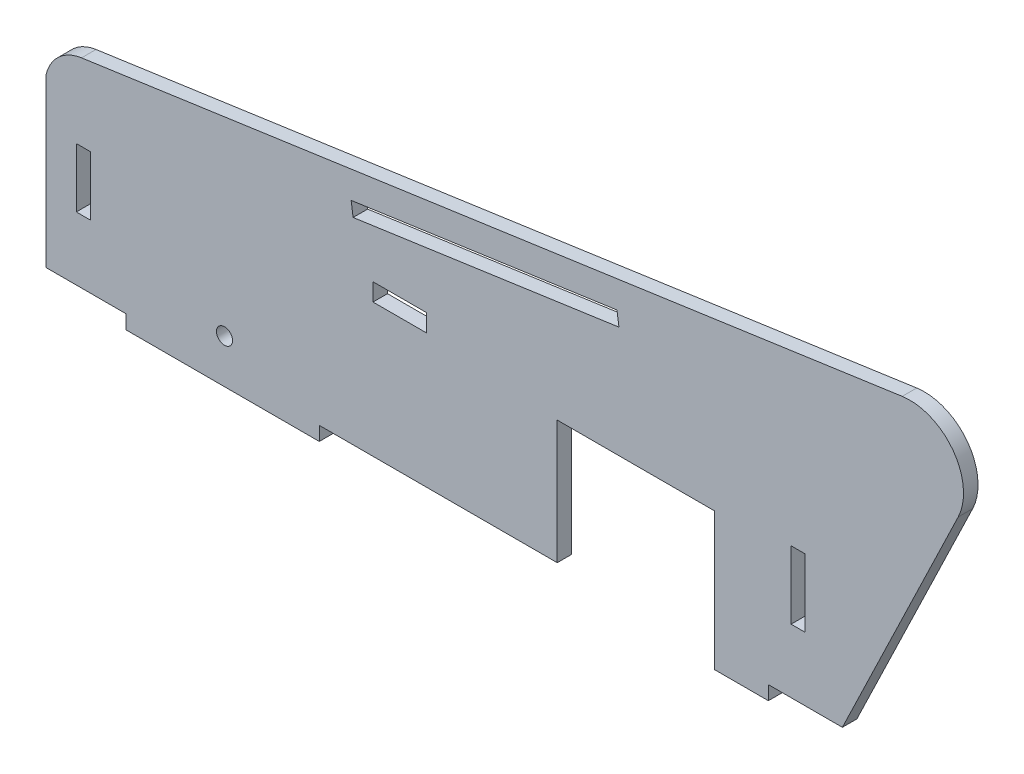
ISO-10303-21;
HEADER;
FILE_DESCRIPTION(('STEP AP214'),'2;1');
FILE_NAME('part.step','',(''),(''),'','','');
FILE_SCHEMA(('AUTOMOTIVE_DESIGN { 1 0 10303 214 1 1 1 1 }'));
ENDSEC;
DATA;
#1=APPLICATION_CONTEXT('core data for automotive mechanical design processes');
#2=APPLICATION_PROTOCOL_DEFINITION('international standard','automotive_design',2000,#1);
#3=PRODUCT_CONTEXT('',#1,'mechanical');
#4=PRODUCT('Part','Part','',(#3));
#5=PRODUCT_RELATED_PRODUCT_CATEGORY('part','',(#4));
#6=PRODUCT_DEFINITION_FORMATION('','',#4);
#7=PRODUCT_DEFINITION_CONTEXT('part definition',#1,'design');
#8=PRODUCT_DEFINITION('design','',#6,#7);
#9=PRODUCT_DEFINITION_SHAPE('','',#8);
#10=(LENGTH_UNIT() NAMED_UNIT(*) SI_UNIT(.MILLI.,.METRE.));
#11=(NAMED_UNIT(*) PLANE_ANGLE_UNIT() SI_UNIT($,.RADIAN.));
#12=(NAMED_UNIT(*) SI_UNIT($,.STERADIAN.) SOLID_ANGLE_UNIT());
#13=UNCERTAINTY_MEASURE_WITH_UNIT(LENGTH_MEASURE(1.E-05),#10,'distance_accuracy_value','');
#14=(GEOMETRIC_REPRESENTATION_CONTEXT(3) GLOBAL_UNCERTAINTY_ASSIGNED_CONTEXT((#13)) GLOBAL_UNIT_ASSIGNED_CONTEXT((#10,
#11,#12)) REPRESENTATION_CONTEXT('',''));
#15=CARTESIAN_POINT('',(0.,0.,0.));
#16=DIRECTION('',(0.,0.,1.));
#17=DIRECTION('',(1.,0.,0.));
#18=AXIS2_PLACEMENT_3D('',#15,#16,#17);
#19=CARTESIAN_POINT('',(125.56052424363,24.1615289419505,2.7));
#20=DIRECTION('',(0.,0.,-1.));
#21=DIRECTION('',(-1.,0.,0.));
#22=AXIS2_PLACEMENT_3D('',#19,#20,#21);
#23=PLANE('',#22);
#24=DIRECTION('',(0.,1.,0.));
#25=VECTOR('',#24,1.);
#26=CARTESIAN_POINT('',(106.053882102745,-0.382796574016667,2.7));
#27=LINE('',#26,#25);
#28=CARTESIAN_POINT('',(106.053882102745,-13.0233806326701,2.7));
#29=VERTEX_POINT('',#28);
#30=CARTESIAN_POINT('',(106.053882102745,-0.382796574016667,2.7));
#31=VERTEX_POINT('',#30);
#32=EDGE_CURVE('E284',#29,#31,#27,.T.);
#33=ORIENTED_EDGE('',*,*,#32,.F.);
#34=DIRECTION('',(1.,0.,0.));
#35=VECTOR('',#34,1.);
#36=CARTESIAN_POINT('',(106.053882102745,-13.0233806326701,2.7));
#37=LINE('',#36,#35);
#38=CARTESIAN_POINT('',(103.453882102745,-13.0233806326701,2.7));
#39=VERTEX_POINT('',#38);
#40=EDGE_CURVE('E292',#39,#29,#37,.T.);
#41=ORIENTED_EDGE('',*,*,#40,.F.);
#42=DIRECTION('',(0.,-1.,0.));
#43=VECTOR('',#42,1.);
#44=CARTESIAN_POINT('',(103.453882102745,-0.382796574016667,2.7));
#45=LINE('',#44,#43);
#46=CARTESIAN_POINT('',(103.453882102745,-0.382796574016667,2.7));
#47=VERTEX_POINT('',#46);
#48=EDGE_CURVE('E289',#47,#39,#45,.T.);
#49=ORIENTED_EDGE('',*,*,#48,.F.);
#50=DIRECTION('',(-1.,0.,0.));
#51=VECTOR('',#50,1.);
#52=CARTESIAN_POINT('',(106.053882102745,-0.382796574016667,2.7));
#53=LINE('',#52,#51);
#54=EDGE_CURVE('E286',#31,#47,#53,.T.);
#55=ORIENTED_EDGE('',*,*,#54,.F.);
#56=EDGE_LOOP('',(#33,#41,#49,#55));
#57=FACE_BOUND('',#56,.T.);
#58=DIRECTION('',(0.,-1.,0.));
#59=VECTOR('',#58,1.);
#60=CARTESIAN_POINT('',(25.6062992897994,3.27012930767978,2.7));
#61=LINE('',#60,#59);
#62=CARTESIAN_POINT('',(25.6062992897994,3.27012930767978,2.7));
#63=VERTEX_POINT('',#62);
#64=CARTESIAN_POINT('',(25.6062992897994,0.,2.7));
#65=VERTEX_POINT('',#64);
#66=EDGE_CURVE('E346',#63,#65,#61,.T.);
#67=ORIENTED_EDGE('',*,*,#66,.F.);
#68=DIRECTION('',(-1.,0.,0.));
#69=VECTOR('',#68,1.);
#70=CARTESIAN_POINT('',(25.6062992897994,3.27012930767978,2.7));
#71=LINE('',#70,#69);
#72=CARTESIAN_POINT('',(35.6062992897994,3.27012930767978,2.7));
#73=VERTEX_POINT('',#72);
#74=EDGE_CURVE('E354',#73,#63,#71,.T.);
#75=ORIENTED_EDGE('',*,*,#74,.F.);
#76=DIRECTION('',(0.,1.,0.));
#77=VECTOR('',#76,1.);
#78=CARTESIAN_POINT('',(35.6062992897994,3.27012930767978,2.7));
#79=LINE('',#78,#77);
#80=CARTESIAN_POINT('',(35.6062992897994,0.,2.7));
#81=VERTEX_POINT('',#80);
#82=EDGE_CURVE('E351',#81,#73,#79,.T.);
#83=ORIENTED_EDGE('',*,*,#82,.F.);
#84=DIRECTION('',(1.,0.,0.));
#85=VECTOR('',#84,1.);
#86=CARTESIAN_POINT('',(25.6062992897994,0.,2.7));
#87=LINE('',#86,#85);
#88=EDGE_CURVE('E348',#65,#81,#87,.T.);
#89=ORIENTED_EDGE('',*,*,#88,.F.);
#90=EDGE_LOOP('',(#67,#75,#83,#89));
#91=FACE_BOUND('',#90,.T.);
#92=DIRECTION('',(0.,-1.,0.));
#93=VECTOR('',#92,1.);
#94=CARTESIAN_POINT('',(-20.3937007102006,-24.8827556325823,2.7));
#95=LINE('',#94,#93);
#96=CARTESIAN_POINT('',(-20.3937007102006,-24.8827556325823,2.7));
#97=VERTEX_POINT('',#96);
#98=CARTESIAN_POINT('',(-20.3937007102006,-27.4827556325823,2.7));
#99=VERTEX_POINT('',#98);
#100=EDGE_CURVE('E377',#97,#99,#95,.T.);
#101=ORIENTED_EDGE('',*,*,#100,.T.);
#102=DIRECTION('',(1.,0.,0.));
#103=VECTOR('',#102,1.);
#104=CARTESIAN_POINT('',(-20.3937007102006,-27.4827556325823,2.7));
#105=LINE('',#104,#103);
#106=CARTESIAN_POINT('',(15.6062992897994,-27.4827556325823,2.7));
#107=VERTEX_POINT('',#106);
#108=EDGE_CURVE('E380',#99,#107,#105,.T.);
#109=ORIENTED_EDGE('',*,*,#108,.T.);
#110=DIRECTION('',(0.,1.,0.));
#111=VECTOR('',#110,1.);
#112=CARTESIAN_POINT('',(15.6062992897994,-24.8827556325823,2.7));
#113=LINE('',#112,#111);
#114=CARTESIAN_POINT('',(15.6062992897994,-24.8827556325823,2.7));
#115=VERTEX_POINT('',#114);
#116=EDGE_CURVE('E383',#107,#115,#113,.T.);
#117=ORIENTED_EDGE('',*,*,#116,.T.);
#118=DIRECTION('',(1.,0.,0.));
#119=VECTOR('',#118,1.);
#120=CARTESIAN_POINT('',(15.6062992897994,-24.8827556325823,2.7));
#121=LINE('',#120,#119);
#122=CARTESIAN_POINT('',(59.9112992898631,-24.8827556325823,2.7));
#123=VERTEX_POINT('',#122);
#124=EDGE_CURVE('E385',#115,#123,#121,.T.);
#125=ORIENTED_EDGE('',*,*,#124,.T.);
#126=DIRECTION('',(0.,1.,0.));
#127=VECTOR('',#126,1.);
#128=CARTESIAN_POINT('',(59.9112992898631,-24.8827556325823,2.7));
#129=LINE('',#128,#127);
#130=CARTESIAN_POINT('',(59.9112992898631,-1.88275563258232,2.7));
#131=VERTEX_POINT('',#130);
#132=EDGE_CURVE('E387',#123,#131,#129,.T.);
#133=ORIENTED_EDGE('',*,*,#132,.T.);
#134=DIRECTION('',(1.,0.,0.));
#135=VECTOR('',#134,1.);
#136=CARTESIAN_POINT('',(59.9112992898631,-1.88275563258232,2.7));
#137=LINE('',#136,#135);
#138=CARTESIAN_POINT('',(89.2162992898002,-1.88275563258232,2.7));
#139=VERTEX_POINT('',#138);
#140=EDGE_CURVE('E389',#131,#139,#137,.T.);
#141=ORIENTED_EDGE('',*,*,#140,.T.);
#142=DIRECTION('',(0.,-1.,0.));
#143=VECTOR('',#142,1.);
#144=CARTESIAN_POINT('',(89.2162992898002,-6.88275563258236,2.7));
#145=LINE('',#144,#143);
#146=CARTESIAN_POINT('',(89.2162992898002,-27.4827556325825,2.7));
#147=VERTEX_POINT('',#146);
#148=EDGE_CURVE('E391',#139,#147,#145,.T.);
#149=ORIENTED_EDGE('',*,*,#148,.T.);
#150=DIRECTION('',(1.,0.,0.));
#151=VECTOR('',#150,1.);
#152=CARTESIAN_POINT('',(89.2162992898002,-27.4827556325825,2.7));
#153=LINE('',#152,#151);
#154=CARTESIAN_POINT('',(99.2227511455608,-27.4827556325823,2.7));
#155=VERTEX_POINT('',#154);
#156=EDGE_CURVE('E393',#147,#155,#153,.T.);
#157=ORIENTED_EDGE('',*,*,#156,.T.);
#158=DIRECTION('',(0.,1.,0.));
#159=VECTOR('',#158,1.);
#160=CARTESIAN_POINT('',(99.2227511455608,-27.4827556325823,2.7));
#161=LINE('',#160,#159);
#162=CARTESIAN_POINT('',(99.2227511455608,-24.8827556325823,2.7));
#163=VERTEX_POINT('',#162);
#164=EDGE_CURVE('E395',#155,#163,#161,.T.);
#165=ORIENTED_EDGE('',*,*,#164,.T.);
#166=DIRECTION('',(1.,0.,0.));
#167=VECTOR('',#166,1.);
#168=CARTESIAN_POINT('',(99.2227511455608,-24.8827556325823,2.7));
#169=LINE('',#168,#167);
#170=CARTESIAN_POINT('',(113.001197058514,-24.8827556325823,2.7));
#171=VERTEX_POINT('',#170);
#172=EDGE_CURVE('E397',#163,#171,#169,.T.);
#173=ORIENTED_EDGE('',*,*,#172,.T.);
#174=DIRECTION('',(0.434537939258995,0.900653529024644,0.));
#175=VECTOR('',#174,1.);
#176=CARTESIAN_POINT('',(134.567059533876,19.8161495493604,2.7));
#177=LINE('',#176,#175);
#178=CARTESIAN_POINT('',(134.567059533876,19.8161495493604,2.7));
#179=VERTEX_POINT('',#178);
#180=EDGE_CURVE('E399',#171,#179,#177,.T.);
#181=ORIENTED_EDGE('',*,*,#180,.T.);
#182=CARTESIAN_POINT('',(125.56052424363,24.1615289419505,2.7));
#183=DIRECTION('',(0.,0.,1.));
#184=DIRECTION('',(-1.,0.,0.));
#185=AXIS2_PLACEMENT_3D('',#182,#183,#184);
#186=CIRCLE('',#185,10.);
#187=CARTESIAN_POINT('',(124.146911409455,34.0611096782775,2.7));
#188=VERTEX_POINT('',#187);
#189=EDGE_CURVE('E401',#179,#188,#186,.T.);
#190=ORIENTED_EDGE('',*,*,#189,.T.);
#191=DIRECTION('',(-0.989958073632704,-0.141361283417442,0.));
#192=VECTOR('',#191,1.);
#193=CARTESIAN_POINT('',(124.146911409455,34.0611096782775,2.7));
#194=LINE('',#193,#192);
#195=CARTESIAN_POINT('',(-28.6699184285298,12.2395964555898,2.7));
#196=VERTEX_POINT('',#195);
#197=EDGE_CURVE('E403',#188,#196,#194,.T.);
#198=ORIENTED_EDGE('',*,*,#197,.T.);
#199=CARTESIAN_POINT('',(-27.5459849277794,4.36865034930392,2.7));
#200=DIRECTION('',(0.,0.,1.));
#201=DIRECTION('',(1.,0.,0.));
#202=AXIS2_PLACEMENT_3D('',#199,#200,#201);
#203=CIRCLE('',#202,7.95078732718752);
#204=CARTESIAN_POINT('',(-35.2811932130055,6.20755543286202,2.7));
#205=VERTEX_POINT('',#204);
#206=EDGE_CURVE('E405',#196,#205,#203,.T.);
#207=ORIENTED_EDGE('',*,*,#206,.T.);
#208=DIRECTION('',(0.,-1.,0.));
#209=VECTOR('',#208,1.);
#210=CARTESIAN_POINT('',(-35.2811932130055,6.20755543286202,2.7));
#211=LINE('',#210,#209);
#212=CARTESIAN_POINT('',(-35.2811932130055,-24.8827556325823,2.7));
#213=VERTEX_POINT('',#212);
#214=EDGE_CURVE('E407',#205,#213,#211,.T.);
#215=ORIENTED_EDGE('',*,*,#214,.T.);
#216=DIRECTION('',(1.,0.,0.));
#217=VECTOR('',#216,1.);
#218=CARTESIAN_POINT('',(-35.2811932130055,-24.8827556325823,2.7));
#219=LINE('',#218,#217);
#220=EDGE_CURVE('E409',#213,#97,#219,.T.);
#221=ORIENTED_EDGE('',*,*,#220,.T.);
#222=EDGE_LOOP('',(#101,#109,#117,#125,#133,#141,#149,#157,#165,#173,#181,#190,#198,#207,#215,#221));
#223=FACE_BOUND('',#222,.T.);
#224=DIRECTION('',(0.,1.,0.));
#225=VECTOR('',#224,1.);
#226=CARTESIAN_POINT('',(-27.0386671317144,-2.06019081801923,2.7));
#227=LINE('',#226,#225);
#228=CARTESIAN_POINT('',(-27.0386671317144,-13.0984057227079,2.7));
#229=VERTEX_POINT('',#228);
#230=CARTESIAN_POINT('',(-27.0386671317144,-2.06019081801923,2.7));
#231=VERTEX_POINT('',#230);
#232=EDGE_CURVE('E315',#229,#231,#227,.T.);
#233=ORIENTED_EDGE('',*,*,#232,.F.);
#234=DIRECTION('',(1.,0.,0.));
#235=VECTOR('',#234,1.);
#236=CARTESIAN_POINT('',(-27.0386671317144,-13.0984057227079,2.7));
#237=LINE('',#236,#235);
#238=CARTESIAN_POINT('',(-29.6386671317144,-13.0984057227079,2.7));
#239=VERTEX_POINT('',#238);
#240=EDGE_CURVE('E323',#239,#229,#237,.T.);
#241=ORIENTED_EDGE('',*,*,#240,.F.);
#242=DIRECTION('',(0.,-1.,0.));
#243=VECTOR('',#242,1.);
#244=CARTESIAN_POINT('',(-29.6386671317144,-2.06019081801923,2.7));
#245=LINE('',#244,#243);
#246=CARTESIAN_POINT('',(-29.6386671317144,-2.06019081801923,2.7));
#247=VERTEX_POINT('',#246);
#248=EDGE_CURVE('E320',#247,#239,#245,.T.);
#249=ORIENTED_EDGE('',*,*,#248,.F.);
#250=DIRECTION('',(-1.,0.,0.));
#251=VECTOR('',#250,1.);
#252=CARTESIAN_POINT('',(-27.0386671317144,-2.06019081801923,2.7));
#253=LINE('',#252,#251);
#254=EDGE_CURVE('E317',#231,#247,#253,.T.);
#255=ORIENTED_EDGE('',*,*,#254,.F.);
#256=EDGE_LOOP('',(#233,#241,#249,#255));
#257=FACE_BOUND('',#256,.T.);
#258=DIRECTION('',(0.141361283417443,-0.989958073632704,0.));
#259=VECTOR('',#258,1.);
#260=CARTESIAN_POINT('',(21.5347916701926,14.3578702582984,2.7));
#261=LINE('',#260,#259);
#262=CARTESIAN_POINT('',(21.5347916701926,14.3578702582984,2.7));
#263=VERTEX_POINT('',#262);
#264=CARTESIAN_POINT('',(21.902331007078,11.7839792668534,2.7));
#265=VERTEX_POINT('',#264);
#266=EDGE_CURVE('E245',#263,#265,#261,.T.);
#267=ORIENTED_EDGE('',*,*,#266,.F.);
#268=DIRECTION('',(-0.989958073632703,-0.141361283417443,0.));
#269=VECTOR('',#268,1.);
#270=CARTESIAN_POINT('',(71.0326953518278,21.4259344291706,2.7));
#271=LINE('',#270,#269);
#272=CARTESIAN_POINT('',(71.0326953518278,21.4259344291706,2.7));
#273=VERTEX_POINT('',#272);
#274=EDGE_CURVE('E268',#273,#263,#271,.T.);
#275=ORIENTED_EDGE('',*,*,#274,.F.);
#276=DIRECTION('',(-0.141361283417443,0.989958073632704,0.));
#277=VECTOR('',#276,1.);
#278=CARTESIAN_POINT('',(71.0326953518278,21.4259344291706,2.7));
#279=LINE('',#278,#277);
#280=CARTESIAN_POINT('',(71.4002346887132,18.8520434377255,2.7));
#281=VERTEX_POINT('',#280);
#282=EDGE_CURVE('E266',#281,#273,#279,.T.);
#283=ORIENTED_EDGE('',*,*,#282,.F.);
#284=DIRECTION('',(0.989958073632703,0.141361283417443,0.));
#285=VECTOR('',#284,1.);
#286=CARTESIAN_POINT('',(71.4002346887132,18.8520434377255,2.7));
#287=LINE('',#286,#285);
#288=EDGE_CURVE('E253',#265,#281,#287,.T.);
#289=ORIENTED_EDGE('',*,*,#288,.F.);
#290=EDGE_LOOP('',(#267,#275,#283,#289));
#291=FACE_BOUND('',#290,.T.);
#292=CARTESIAN_POINT('',(-2.04276098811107,-19.301130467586,2.7));
#293=DIRECTION('',(0.,0.,1.));
#294=DIRECTION('',(1.,0.,0.));
#295=AXIS2_PLACEMENT_3D('',#292,#293,#294);
#296=CIRCLE('',#295,1.5);
#297=CARTESIAN_POINT('',(-3.54276098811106,-19.301130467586,2.7));
#298=VERTEX_POINT('',#297);
#299=EDGE_CURVE('E274',#298,#298,#296,.T.);
#300=ORIENTED_EDGE('',*,*,#299,.F.);
#301=EDGE_LOOP('',(#300));
#302=FACE_BOUND('',#301,.T.);
#303=ADVANCED_FACE('F36',(#57,#91,#223,#257,#291,#302),#23,.F.);
#304=CARTESIAN_POINT('',(125.56052424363,24.1615289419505,0.));
#305=DIRECTION('',(0.,0.,-1.));
#306=DIRECTION('',(-1.,0.,0.));
#307=AXIS2_PLACEMENT_3D('',#304,#305,#306);
#308=PLANE('',#307);
#309=DIRECTION('',(-0.989958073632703,-0.141361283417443,0.));
#310=VECTOR('',#309,1.);
#311=CARTESIAN_POINT('',(71.0326953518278,21.4259344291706,0.));
#312=LINE('',#311,#310);
#313=CARTESIAN_POINT('',(71.0326953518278,21.4259344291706,0.));
#314=VERTEX_POINT('',#313);
#315=CARTESIAN_POINT('',(21.5347916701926,14.3578702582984,0.));
#316=VERTEX_POINT('',#315);
#317=EDGE_CURVE('E254',#314,#316,#312,.T.);
#318=ORIENTED_EDGE('',*,*,#317,.T.);
#319=DIRECTION('',(0.141361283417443,-0.989958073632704,0.));
#320=VECTOR('',#319,1.);
#321=CARTESIAN_POINT('',(21.5347916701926,14.3578702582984,0.));
#322=LINE('',#321,#320);
#323=CARTESIAN_POINT('',(21.902331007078,11.7839792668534,0.));
#324=VERTEX_POINT('',#323);
#325=EDGE_CURVE('E59',#316,#324,#322,.T.);
#326=ORIENTED_EDGE('',*,*,#325,.T.);
#327=DIRECTION('',(0.989958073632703,0.141361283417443,0.));
#328=VECTOR('',#327,1.);
#329=CARTESIAN_POINT('',(71.4002346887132,18.8520434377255,0.));
#330=LINE('',#329,#328);
#331=CARTESIAN_POINT('',(71.4002346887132,18.8520434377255,0.));
#332=VERTEX_POINT('',#331);
#333=EDGE_CURVE('E260',#324,#332,#330,.T.);
#334=ORIENTED_EDGE('',*,*,#333,.T.);
#335=DIRECTION('',(-0.141361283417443,0.989958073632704,0.));
#336=VECTOR('',#335,1.);
#337=CARTESIAN_POINT('',(71.0326953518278,21.4259344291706,0.));
#338=LINE('',#337,#336);
#339=EDGE_CURVE('E276',#332,#314,#338,.T.);
#340=ORIENTED_EDGE('',*,*,#339,.T.);
#341=EDGE_LOOP('',(#318,#326,#334,#340));
#342=FACE_BOUND('',#341,.T.);
#343=DIRECTION('',(1.,0.,0.));
#344=VECTOR('',#343,1.);
#345=CARTESIAN_POINT('',(106.053882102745,-13.0233806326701,0.));
#346=LINE('',#345,#344);
#347=CARTESIAN_POINT('',(103.453882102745,-13.0233806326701,0.));
#348=VERTEX_POINT('',#347);
#349=CARTESIAN_POINT('',(106.053882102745,-13.0233806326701,0.));
#350=VERTEX_POINT('',#349);
#351=EDGE_CURVE('E287',#348,#350,#346,.T.);
#352=ORIENTED_EDGE('',*,*,#351,.T.);
#353=DIRECTION('',(0.,1.,0.));
#354=VECTOR('',#353,1.);
#355=CARTESIAN_POINT('',(106.053882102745,-0.382796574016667,0.));
#356=LINE('',#355,#354);
#357=CARTESIAN_POINT('',(106.053882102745,-0.382796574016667,0.));
#358=VERTEX_POINT('',#357);
#359=EDGE_CURVE('E261',#350,#358,#356,.T.);
#360=ORIENTED_EDGE('',*,*,#359,.T.);
#361=DIRECTION('',(-1.,0.,0.));
#362=VECTOR('',#361,1.);
#363=CARTESIAN_POINT('',(106.053882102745,-0.382796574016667,0.));
#364=LINE('',#363,#362);
#365=CARTESIAN_POINT('',(103.453882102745,-0.382796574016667,0.));
#366=VERTEX_POINT('',#365);
#367=EDGE_CURVE('E297',#358,#366,#364,.T.);
#368=ORIENTED_EDGE('',*,*,#367,.T.);
#369=DIRECTION('',(0.,-1.,0.));
#370=VECTOR('',#369,1.);
#371=CARTESIAN_POINT('',(103.453882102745,-0.382796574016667,0.));
#372=LINE('',#371,#370);
#373=EDGE_CURVE('E300',#366,#348,#372,.T.);
#374=ORIENTED_EDGE('',*,*,#373,.T.);
#375=EDGE_LOOP('',(#352,#360,#368,#374));
#376=FACE_BOUND('',#375,.T.);
#377=DIRECTION('',(1.,0.,0.));
#378=VECTOR('',#377,1.);
#379=CARTESIAN_POINT('',(-27.0386671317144,-13.0984057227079,0.));
#380=LINE('',#379,#378);
#381=CARTESIAN_POINT('',(-29.6386671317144,-13.0984057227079,0.));
#382=VERTEX_POINT('',#381);
#383=CARTESIAN_POINT('',(-27.0386671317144,-13.0984057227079,0.));
#384=VERTEX_POINT('',#383);
#385=EDGE_CURVE('E318',#382,#384,#380,.T.);
#386=ORIENTED_EDGE('',*,*,#385,.T.);
#387=DIRECTION('',(0.,1.,0.));
#388=VECTOR('',#387,1.);
#389=CARTESIAN_POINT('',(-27.0386671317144,-2.06019081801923,0.));
#390=LINE('',#389,#388);
#391=CARTESIAN_POINT('',(-27.0386671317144,-2.06019081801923,0.));
#392=VERTEX_POINT('',#391);
#393=EDGE_CURVE('E314',#384,#392,#390,.T.);
#394=ORIENTED_EDGE('',*,*,#393,.T.);
#395=DIRECTION('',(-1.,0.,0.));
#396=VECTOR('',#395,1.);
#397=CARTESIAN_POINT('',(-27.0386671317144,-2.06019081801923,0.));
#398=LINE('',#397,#396);
#399=CARTESIAN_POINT('',(-29.6386671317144,-2.06019081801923,0.));
#400=VERTEX_POINT('',#399);
#401=EDGE_CURVE('E328',#392,#400,#398,.T.);
#402=ORIENTED_EDGE('',*,*,#401,.T.);
#403=DIRECTION('',(0.,-1.,0.));
#404=VECTOR('',#403,1.);
#405=CARTESIAN_POINT('',(-29.6386671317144,-2.06019081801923,0.));
#406=LINE('',#405,#404);
#407=EDGE_CURVE('E331',#400,#382,#406,.T.);
#408=ORIENTED_EDGE('',*,*,#407,.T.);
#409=EDGE_LOOP('',(#386,#394,#402,#408));
#410=FACE_BOUND('',#409,.T.);
#411=DIRECTION('',(-1.,0.,0.));
#412=VECTOR('',#411,1.);
#413=CARTESIAN_POINT('',(25.6062992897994,3.27012930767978,0.));
#414=LINE('',#413,#412);
#415=CARTESIAN_POINT('',(35.6062992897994,3.27012930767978,0.));
#416=VERTEX_POINT('',#415);
#417=CARTESIAN_POINT('',(25.6062992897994,3.27012930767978,0.));
#418=VERTEX_POINT('',#417);
#419=EDGE_CURVE('E349',#416,#418,#414,.T.);
#420=ORIENTED_EDGE('',*,*,#419,.T.);
#421=DIRECTION('',(0.,-1.,0.));
#422=VECTOR('',#421,1.);
#423=CARTESIAN_POINT('',(25.6062992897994,3.27012930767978,0.));
#424=LINE('',#423,#422);
#425=CARTESIAN_POINT('',(25.6062992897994,0.,0.));
#426=VERTEX_POINT('',#425);
#427=EDGE_CURVE('E345',#418,#426,#424,.T.);
#428=ORIENTED_EDGE('',*,*,#427,.T.);
#429=DIRECTION('',(1.,0.,0.));
#430=VECTOR('',#429,1.);
#431=CARTESIAN_POINT('',(25.6062992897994,0.,0.));
#432=LINE('',#431,#430);
#433=CARTESIAN_POINT('',(35.6062992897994,0.,0.));
#434=VERTEX_POINT('',#433);
#435=EDGE_CURVE('E359',#426,#434,#432,.T.);
#436=ORIENTED_EDGE('',*,*,#435,.T.);
#437=DIRECTION('',(0.,1.,0.));
#438=VECTOR('',#437,1.);
#439=CARTESIAN_POINT('',(35.6062992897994,3.27012930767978,0.));
#440=LINE('',#439,#438);
#441=EDGE_CURVE('E362',#434,#416,#440,.T.);
#442=ORIENTED_EDGE('',*,*,#441,.T.);
#443=EDGE_LOOP('',(#420,#428,#436,#442));
#444=FACE_BOUND('',#443,.T.);
#445=DIRECTION('',(0.,-1.,0.));
#446=VECTOR('',#445,1.);
#447=CARTESIAN_POINT('',(-20.3937007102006,-24.8827556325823,0.));
#448=LINE('',#447,#446);
#449=CARTESIAN_POINT('',(-20.3937007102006,-24.8827556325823,0.));
#450=VERTEX_POINT('',#449);
#451=CARTESIAN_POINT('',(-20.3937007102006,-27.4827556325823,0.));
#452=VERTEX_POINT('',#451);
#453=EDGE_CURVE('E376',#450,#452,#448,.T.);
#454=ORIENTED_EDGE('',*,*,#453,.F.);
#455=DIRECTION('',(1.,0.,0.));
#456=VECTOR('',#455,1.);
#457=CARTESIAN_POINT('',(-35.2811932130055,-24.8827556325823,0.));
#458=LINE('',#457,#456);
#459=CARTESIAN_POINT('',(-35.2811932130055,-24.8827556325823,0.));
#460=VERTEX_POINT('',#459);
#461=EDGE_CURVE('E381',#460,#450,#458,.T.);
#462=ORIENTED_EDGE('',*,*,#461,.F.);
#463=DIRECTION('',(0.,-1.,0.));
#464=VECTOR('',#463,1.);
#465=CARTESIAN_POINT('',(-35.2811932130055,6.20755543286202,0.));
#466=LINE('',#465,#464);
#467=CARTESIAN_POINT('',(-35.2811932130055,6.20755543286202,0.));
#468=VERTEX_POINT('',#467);
#469=EDGE_CURVE('E443',#468,#460,#466,.T.);
#470=ORIENTED_EDGE('',*,*,#469,.F.);
#471=CARTESIAN_POINT('',(-27.5459849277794,4.36865034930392,0.));
#472=DIRECTION('',(0.,0.,1.));
#473=DIRECTION('',(1.,0.,0.));
#474=AXIS2_PLACEMENT_3D('',#471,#472,#473);
#475=CIRCLE('',#474,7.95078732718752);
#476=CARTESIAN_POINT('',(-28.6699184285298,12.2395964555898,0.));
#477=VERTEX_POINT('',#476);
#478=EDGE_CURVE('E441',#477,#468,#475,.T.);
#479=ORIENTED_EDGE('',*,*,#478,.F.);
#480=DIRECTION('',(-0.989958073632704,-0.141361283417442,0.));
#481=VECTOR('',#480,1.);
#482=CARTESIAN_POINT('',(124.146911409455,34.0611096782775,0.));
#483=LINE('',#482,#481);
#484=CARTESIAN_POINT('',(124.146911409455,34.0611096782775,0.));
#485=VERTEX_POINT('',#484);
#486=EDGE_CURVE('E439',#485,#477,#483,.T.);
#487=ORIENTED_EDGE('',*,*,#486,.F.);
#488=CARTESIAN_POINT('',(125.56052424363,24.1615289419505,0.));
#489=DIRECTION('',(0.,0.,1.));
#490=DIRECTION('',(-1.,0.,0.));
#491=AXIS2_PLACEMENT_3D('',#488,#489,#490);
#492=CIRCLE('',#491,10.);
#493=CARTESIAN_POINT('',(134.567059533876,19.8161495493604,0.));
#494=VERTEX_POINT('',#493);
#495=EDGE_CURVE('E437',#494,#485,#492,.T.);
#496=ORIENTED_EDGE('',*,*,#495,.F.);
#497=DIRECTION('',(0.434537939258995,0.900653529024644,0.));
#498=VECTOR('',#497,1.);
#499=CARTESIAN_POINT('',(134.567059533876,19.8161495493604,0.));
#500=LINE('',#499,#498);
#501=CARTESIAN_POINT('',(113.001197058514,-24.8827556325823,0.));
#502=VERTEX_POINT('',#501);
#503=EDGE_CURVE('E435',#502,#494,#500,.T.);
#504=ORIENTED_EDGE('',*,*,#503,.F.);
#505=DIRECTION('',(1.,0.,0.));
#506=VECTOR('',#505,1.);
#507=CARTESIAN_POINT('',(99.2227511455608,-24.8827556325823,0.));
#508=LINE('',#507,#506);
#509=CARTESIAN_POINT('',(99.2227511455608,-24.8827556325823,0.));
#510=VERTEX_POINT('',#509);
#511=EDGE_CURVE('E433',#510,#502,#508,.T.);
#512=ORIENTED_EDGE('',*,*,#511,.F.);
#513=DIRECTION('',(0.,1.,0.));
#514=VECTOR('',#513,1.);
#515=CARTESIAN_POINT('',(99.2227511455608,-27.4827556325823,0.));
#516=LINE('',#515,#514);
#517=CARTESIAN_POINT('',(99.2227511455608,-27.4827556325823,0.));
#518=VERTEX_POINT('',#517);
#519=EDGE_CURVE('E431',#518,#510,#516,.T.);
#520=ORIENTED_EDGE('',*,*,#519,.F.);
#521=DIRECTION('',(1.,0.,0.));
#522=VECTOR('',#521,1.);
#523=CARTESIAN_POINT('',(89.2162992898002,-27.4827556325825,0.));
#524=LINE('',#523,#522);
#525=CARTESIAN_POINT('',(89.2162992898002,-27.4827556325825,0.));
#526=VERTEX_POINT('',#525);
#527=EDGE_CURVE('E429',#526,#518,#524,.T.);
#528=ORIENTED_EDGE('',*,*,#527,.F.);
#529=DIRECTION('',(0.,-1.,0.));
#530=VECTOR('',#529,1.);
#531=CARTESIAN_POINT('',(89.2162992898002,-6.88275563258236,0.));
#532=LINE('',#531,#530);
#533=CARTESIAN_POINT('',(89.2162992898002,-1.88275563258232,0.));
#534=VERTEX_POINT('',#533);
#535=EDGE_CURVE('E427',#534,#526,#532,.T.);
#536=ORIENTED_EDGE('',*,*,#535,.F.);
#537=DIRECTION('',(1.,0.,0.));
#538=VECTOR('',#537,1.);
#539=CARTESIAN_POINT('',(59.9112992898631,-1.88275563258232,0.));
#540=LINE('',#539,#538);
#541=CARTESIAN_POINT('',(59.9112992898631,-1.88275563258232,0.));
#542=VERTEX_POINT('',#541);
#543=EDGE_CURVE('E424',#542,#534,#540,.T.);
#544=ORIENTED_EDGE('',*,*,#543,.F.);
#545=DIRECTION('',(0.,1.,0.));
#546=VECTOR('',#545,1.);
#547=CARTESIAN_POINT('',(59.9112992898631,-6.88275563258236,0.));
#548=LINE('',#547,#546);
#549=CARTESIAN_POINT('',(59.9112992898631,-24.8827556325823,0.));
#550=VERTEX_POINT('',#549);
#551=EDGE_CURVE('E422',#550,#542,#548,.T.);
#552=ORIENTED_EDGE('',*,*,#551,.F.);
#553=DIRECTION('',(1.,0.,0.));
#554=VECTOR('',#553,1.);
#555=CARTESIAN_POINT('',(20.2162992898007,-24.8827556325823,0.));
#556=LINE('',#555,#554);
#557=CARTESIAN_POINT('',(15.6062992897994,-24.8827556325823,0.));
#558=VERTEX_POINT('',#557);
#559=EDGE_CURVE('E419',#558,#550,#556,.T.);
#560=ORIENTED_EDGE('',*,*,#559,.F.);
#561=DIRECTION('',(0.,1.,0.));
#562=VECTOR('',#561,1.);
#563=CARTESIAN_POINT('',(15.6062992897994,-24.8827556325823,0.));
#564=LINE('',#563,#562);
#565=CARTESIAN_POINT('',(15.6062992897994,-27.4827556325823,0.));
#566=VERTEX_POINT('',#565);
#567=EDGE_CURVE('E416',#566,#558,#564,.T.);
#568=ORIENTED_EDGE('',*,*,#567,.F.);
#569=DIRECTION('',(1.,0.,0.));
#570=VECTOR('',#569,1.);
#571=CARTESIAN_POINT('',(-20.3937007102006,-27.4827556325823,0.));
#572=LINE('',#571,#570);
#573=EDGE_CURVE('E414',#452,#566,#572,.T.);
#574=ORIENTED_EDGE('',*,*,#573,.F.);
#575=EDGE_LOOP('',(#454,#462,#470,#479,#487,#496,#504,#512,#520,#528,#536,#544,#552,#560,#568,#574));
#576=FACE_BOUND('',#575,.T.);
#577=CARTESIAN_POINT('',(-2.04276098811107,-19.301130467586,0.));
#578=DIRECTION('',(0.,0.,1.));
#579=DIRECTION('',(1.,0.,0.));
#580=AXIS2_PLACEMENT_3D('',#577,#578,#579);
#581=CIRCLE('',#580,1.5);
#582=CARTESIAN_POINT('',(-3.54276098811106,-19.301130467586,0.));
#583=VERTEX_POINT('',#582);
#584=EDGE_CURVE('E906',#583,#583,#581,.T.);
#585=ORIENTED_EDGE('',*,*,#584,.T.);
#586=EDGE_LOOP('',(#585));
#587=FACE_BOUND('',#586,.T.);
#588=ADVANCED_FACE('F496',(#342,#376,#410,#444,#576,#587),#308,.T.);
#589=CARTESIAN_POINT('',(-20.3937007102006,-24.8827556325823,2.7));
#590=DIRECTION('',(1.,0.,0.));
#591=DIRECTION('',(0.,0.,-1.));
#592=AXIS2_PLACEMENT_3D('',#589,#590,#591);
#593=PLANE('',#592);
#594=ORIENTED_EDGE('',*,*,#453,.T.);
#595=DIRECTION('',(0.,0.,-1.));
#596=VECTOR('',#595,1.);
#597=CARTESIAN_POINT('',(-20.3937007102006,-27.4827556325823,2.7));
#598=LINE('',#597,#596);
#599=EDGE_CURVE('E11',#99,#452,#598,.T.);
#600=ORIENTED_EDGE('',*,*,#599,.F.);
#601=ORIENTED_EDGE('',*,*,#100,.F.);
#602=DIRECTION('',(0.,0.,-1.));
#603=VECTOR('',#602,1.);
#604=CARTESIAN_POINT('',(-20.3937007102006,-24.8827556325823,2.7));
#605=LINE('',#604,#603);
#606=EDGE_CURVE('E411',#97,#450,#605,.T.);
#607=ORIENTED_EDGE('',*,*,#606,.T.);
#608=EDGE_LOOP('',(#594,#600,#601,#607));
#609=FACE_BOUND('',#608,.T.);
#610=ADVANCED_FACE('F38',(#609),#593,.F.);
#611=CARTESIAN_POINT('',(-20.3937007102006,-27.4827556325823,2.7));
#612=DIRECTION('',(0.,1.,0.));
#613=DIRECTION('',(0.,0.,1.));
#614=AXIS2_PLACEMENT_3D('',#611,#612,#613);
#615=PLANE('',#614);
#616=ORIENTED_EDGE('',*,*,#573,.T.);
#617=DIRECTION('',(0.,0.,-1.));
#618=VECTOR('',#617,1.);
#619=CARTESIAN_POINT('',(15.6062992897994,-27.4827556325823,2.7));
#620=LINE('',#619,#618);
#621=EDGE_CURVE('E44',#107,#566,#620,.T.);
#622=ORIENTED_EDGE('',*,*,#621,.F.);
#623=ORIENTED_EDGE('',*,*,#108,.F.);
#624=ORIENTED_EDGE('',*,*,#599,.T.);
#625=EDGE_LOOP('',(#616,#622,#623,#624));
#626=FACE_BOUND('',#625,.T.);
#627=ADVANCED_FACE('F513',(#626),#615,.F.);
#628=CARTESIAN_POINT('',(15.6062992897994,-24.8827556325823,2.7));
#629=DIRECTION('',(-1.,0.,0.));
#630=DIRECTION('',(0.,0.,1.));
#631=AXIS2_PLACEMENT_3D('',#628,#629,#630);
#632=PLANE('',#631);
#633=ORIENTED_EDGE('',*,*,#567,.T.);
#634=DIRECTION('',(0.,0.,-1.));
#635=VECTOR('',#634,1.);
#636=CARTESIAN_POINT('',(15.6062992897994,-24.8827556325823,2.7));
#637=LINE('',#636,#635);
#638=EDGE_CURVE('E484',#115,#558,#637,.T.);
#639=ORIENTED_EDGE('',*,*,#638,.F.);
#640=ORIENTED_EDGE('',*,*,#116,.F.);
#641=ORIENTED_EDGE('',*,*,#621,.T.);
#642=EDGE_LOOP('',(#633,#639,#640,#641));
#643=FACE_BOUND('',#642,.T.);
#644=ADVANCED_FACE('F491',(#643),#632,.F.);
#645=CARTESIAN_POINT('',(20.2162992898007,-24.8827556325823,2.7));
#646=DIRECTION('',(0.,1.,0.));
#647=DIRECTION('',(-1.,0.,0.));
#648=AXIS2_PLACEMENT_3D('',#645,#646,#647);
#649=PLANE('',#648);
#650=ORIENTED_EDGE('',*,*,#559,.T.);
#651=DIRECTION('',(0.,0.,-1.));
#652=VECTOR('',#651,1.);
#653=CARTESIAN_POINT('',(59.9112992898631,-24.8827556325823,2.7));
#654=LINE('',#653,#652);
#655=EDGE_CURVE('E481',#123,#550,#654,.T.);
#656=ORIENTED_EDGE('',*,*,#655,.F.);
#657=ORIENTED_EDGE('',*,*,#124,.F.);
#658=ORIENTED_EDGE('',*,*,#638,.T.);
#659=EDGE_LOOP('',(#650,#656,#657,#658));
#660=FACE_BOUND('',#659,.T.);
#661=ADVANCED_FACE('F501',(#660),#649,.F.);
#662=CARTESIAN_POINT('',(59.9112992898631,-6.88275563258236,2.7));
#663=DIRECTION('',(-1.,0.,0.));
#664=DIRECTION('',(0.,0.,1.));
#665=AXIS2_PLACEMENT_3D('',#662,#663,#664);
#666=PLANE('',#665);
#667=ORIENTED_EDGE('',*,*,#551,.T.);
#668=DIRECTION('',(0.,0.,-1.));
#669=VECTOR('',#668,1.);
#670=CARTESIAN_POINT('',(59.9112992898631,-1.88275563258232,2.7));
#671=LINE('',#670,#669);
#672=EDGE_CURVE('E478',#131,#542,#671,.T.);
#673=ORIENTED_EDGE('',*,*,#672,.F.);
#674=ORIENTED_EDGE('',*,*,#132,.F.);
#675=ORIENTED_EDGE('',*,*,#655,.T.);
#676=EDGE_LOOP('',(#667,#673,#674,#675));
#677=FACE_BOUND('',#676,.T.);
#678=ADVANCED_FACE('F505',(#677),#666,.F.);
#679=CARTESIAN_POINT('',(59.9112992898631,-1.88275563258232,2.7));
#680=DIRECTION('',(0.,1.,0.));
#681=DIRECTION('',(0.,0.,1.));
#682=AXIS2_PLACEMENT_3D('',#679,#680,#681);
#683=PLANE('',#682);
#684=ORIENTED_EDGE('',*,*,#543,.T.);
#685=DIRECTION('',(0.,0.,-1.));
#686=VECTOR('',#685,1.);
#687=CARTESIAN_POINT('',(89.2162992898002,-1.88275563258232,2.7));
#688=LINE('',#687,#686);
#689=EDGE_CURVE('E475',#139,#534,#688,.T.);
#690=ORIENTED_EDGE('',*,*,#689,.F.);
#691=ORIENTED_EDGE('',*,*,#140,.F.);
#692=ORIENTED_EDGE('',*,*,#672,.T.);
#693=EDGE_LOOP('',(#684,#690,#691,#692));
#694=FACE_BOUND('',#693,.T.);
#695=ADVANCED_FACE('F563',(#694),#683,.F.);
#696=CARTESIAN_POINT('',(89.2162992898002,-6.88275563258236,2.7));
#697=DIRECTION('',(1.,0.,0.));
#698=DIRECTION('',(0.,0.,-1.));
#699=AXIS2_PLACEMENT_3D('',#696,#697,#698);
#700=PLANE('',#699);
#701=ORIENTED_EDGE('',*,*,#535,.T.);
#702=DIRECTION('',(0.,0.,-1.));
#703=VECTOR('',#702,1.);
#704=CARTESIAN_POINT('',(89.2162992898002,-27.4827556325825,2.7));
#705=LINE('',#704,#703);
#706=EDGE_CURVE('E472',#147,#526,#705,.T.);
#707=ORIENTED_EDGE('',*,*,#706,.F.);
#708=ORIENTED_EDGE('',*,*,#148,.F.);
#709=ORIENTED_EDGE('',*,*,#689,.T.);
#710=EDGE_LOOP('',(#701,#707,#708,#709));
#711=FACE_BOUND('',#710,.T.);
#712=ADVANCED_FACE('F565',(#711),#700,.F.);
#713=CARTESIAN_POINT('',(89.2162992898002,-27.4827556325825,2.7));
#714=DIRECTION('',(0.,1.,0.));
#715=DIRECTION('',(-1.,0.,0.));
#716=AXIS2_PLACEMENT_3D('',#713,#714,#715);
#717=PLANE('',#716);
#718=ORIENTED_EDGE('',*,*,#527,.T.);
#719=DIRECTION('',(0.,0.,-1.));
#720=VECTOR('',#719,1.);
#721=CARTESIAN_POINT('',(99.2227511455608,-27.4827556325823,2.7));
#722=LINE('',#721,#720);
#723=EDGE_CURVE('E469',#155,#518,#722,.T.);
#724=ORIENTED_EDGE('',*,*,#723,.F.);
#725=ORIENTED_EDGE('',*,*,#156,.F.);
#726=ORIENTED_EDGE('',*,*,#706,.T.);
#727=EDGE_LOOP('',(#718,#724,#725,#726));
#728=FACE_BOUND('',#727,.T.);
#729=ADVANCED_FACE('F559',(#728),#717,.F.);
#730=CARTESIAN_POINT('',(99.2227511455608,-27.4827556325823,2.7));
#731=DIRECTION('',(-1.,0.,0.));
#732=DIRECTION('',(0.,0.,1.));
#733=AXIS2_PLACEMENT_3D('',#730,#731,#732);
#734=PLANE('',#733);
#735=ORIENTED_EDGE('',*,*,#519,.T.);
#736=DIRECTION('',(0.,0.,-1.));
#737=VECTOR('',#736,1.);
#738=CARTESIAN_POINT('',(99.2227511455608,-24.8827556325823,2.7));
#739=LINE('',#738,#737);
#740=EDGE_CURVE('E466',#163,#510,#739,.T.);
#741=ORIENTED_EDGE('',*,*,#740,.F.);
#742=ORIENTED_EDGE('',*,*,#164,.F.);
#743=ORIENTED_EDGE('',*,*,#723,.T.);
#744=EDGE_LOOP('',(#735,#741,#742,#743));
#745=FACE_BOUND('',#744,.T.);
#746=ADVANCED_FACE('F555',(#745),#734,.F.);
#747=CARTESIAN_POINT('',(99.2227511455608,-24.8827556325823,2.7));
#748=DIRECTION('',(0.,1.,0.));
#749=DIRECTION('',(0.,0.,1.));
#750=AXIS2_PLACEMENT_3D('',#747,#748,#749);
#751=PLANE('',#750);
#752=ORIENTED_EDGE('',*,*,#511,.T.);
#753=DIRECTION('',(0.,0.,-1.));
#754=VECTOR('',#753,1.);
#755=CARTESIAN_POINT('',(113.001197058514,-24.8827556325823,2.7));
#756=LINE('',#755,#754);
#757=EDGE_CURVE('E463',#171,#502,#756,.T.);
#758=ORIENTED_EDGE('',*,*,#757,.F.);
#759=ORIENTED_EDGE('',*,*,#172,.F.);
#760=ORIENTED_EDGE('',*,*,#740,.T.);
#761=EDGE_LOOP('',(#752,#758,#759,#760));
#762=FACE_BOUND('',#761,.T.);
#763=ADVANCED_FACE('F550',(#762),#751,.F.);
#764=CARTESIAN_POINT('',(134.567059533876,19.8161495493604,2.7));
#765=DIRECTION('',(-0.900653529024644,0.434537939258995,0.));
#766=DIRECTION('',(-0.434537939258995,-0.900653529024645,0.));
#767=AXIS2_PLACEMENT_3D('',#764,#765,#766);
#768=PLANE('',#767);
#769=ORIENTED_EDGE('',*,*,#503,.T.);
#770=DIRECTION('',(0.,0.,-1.));
#771=VECTOR('',#770,1.);
#772=CARTESIAN_POINT('',(134.567059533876,19.8161495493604,2.7));
#773=LINE('',#772,#771);
#774=EDGE_CURVE('E460',#179,#494,#773,.T.);
#775=ORIENTED_EDGE('',*,*,#774,.F.);
#776=ORIENTED_EDGE('',*,*,#180,.F.);
#777=ORIENTED_EDGE('',*,*,#757,.T.);
#778=EDGE_LOOP('',(#769,#775,#776,#777));
#779=FACE_BOUND('',#778,.T.);
#780=ADVANCED_FACE('F544',(#779),#768,.F.);
#781=CARTESIAN_POINT('',(125.56052424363,24.1615289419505,2.7));
#782=DIRECTION('',(0.,0.,-1.));
#783=DIRECTION('',(-1.,0.,0.));
#784=AXIS2_PLACEMENT_3D('',#781,#782,#783);
#785=CYLINDRICAL_SURFACE('',#784,10.);
#786=ORIENTED_EDGE('',*,*,#495,.T.);
#787=DIRECTION('',(0.,0.,-1.));
#788=VECTOR('',#787,1.);
#789=CARTESIAN_POINT('',(124.146911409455,34.0611096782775,2.7));
#790=LINE('',#789,#788);
#791=EDGE_CURVE('E457',#188,#485,#790,.T.);
#792=ORIENTED_EDGE('',*,*,#791,.F.);
#793=ORIENTED_EDGE('',*,*,#189,.F.);
#794=ORIENTED_EDGE('',*,*,#774,.T.);
#795=EDGE_LOOP('',(#786,#792,#793,#794));
#796=FACE_BOUND('',#795,.T.);
#797=ADVANCED_FACE('F540',(#796),#785,.T.);
#798=CARTESIAN_POINT('',(124.146911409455,34.0611096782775,2.7));
#799=DIRECTION('',(0.141361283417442,-0.989958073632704,0.));
#800=DIRECTION('',(0.989958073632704,0.141361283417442,0.));
#801=AXIS2_PLACEMENT_3D('',#798,#799,#800);
#802=PLANE('',#801);
#803=ORIENTED_EDGE('',*,*,#486,.T.);
#804=DIRECTION('',(0.,0.,-1.));
#805=VECTOR('',#804,1.);
#806=CARTESIAN_POINT('',(-28.6699184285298,12.2395964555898,2.7));
#807=LINE('',#806,#805);
#808=EDGE_CURVE('E454',#196,#477,#807,.T.);
#809=ORIENTED_EDGE('',*,*,#808,.F.);
#810=ORIENTED_EDGE('',*,*,#197,.F.);
#811=ORIENTED_EDGE('',*,*,#791,.T.);
#812=EDGE_LOOP('',(#803,#809,#810,#811));
#813=FACE_BOUND('',#812,.T.);
#814=ADVANCED_FACE('F535',(#813),#802,.F.);
#815=CARTESIAN_POINT('',(-27.5459849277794,4.36865034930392,2.7));
#816=DIRECTION('',(0.,0.,-1.));
#817=DIRECTION('',(-1.,0.,0.));
#818=AXIS2_PLACEMENT_3D('',#815,#816,#817);
#819=CYLINDRICAL_SURFACE('',#818,7.95078732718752);
#820=ORIENTED_EDGE('',*,*,#478,.T.);
#821=DIRECTION('',(0.,0.,-1.));
#822=VECTOR('',#821,1.);
#823=CARTESIAN_POINT('',(-35.2811932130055,6.20755543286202,2.7));
#824=LINE('',#823,#822);
#825=EDGE_CURVE('E451',#205,#468,#824,.T.);
#826=ORIENTED_EDGE('',*,*,#825,.F.);
#827=ORIENTED_EDGE('',*,*,#206,.F.);
#828=ORIENTED_EDGE('',*,*,#808,.T.);
#829=EDGE_LOOP('',(#820,#826,#827,#828));
#830=FACE_BOUND('',#829,.T.);
#831=ADVANCED_FACE('F529',(#830),#819,.T.);
#832=CARTESIAN_POINT('',(-35.2811932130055,6.20755543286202,2.7));
#833=DIRECTION('',(1.,0.,0.));
#834=DIRECTION('',(0.,1.,0.));
#835=AXIS2_PLACEMENT_3D('',#832,#833,#834);
#836=PLANE('',#835);
#837=ORIENTED_EDGE('',*,*,#469,.T.);
#838=DIRECTION('',(0.,0.,-1.));
#839=VECTOR('',#838,1.);
#840=CARTESIAN_POINT('',(-35.2811932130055,-24.8827556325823,2.7));
#841=LINE('',#840,#839);
#842=EDGE_CURVE('E448',#213,#460,#841,.T.);
#843=ORIENTED_EDGE('',*,*,#842,.F.);
#844=ORIENTED_EDGE('',*,*,#214,.F.);
#845=ORIENTED_EDGE('',*,*,#825,.T.);
#846=EDGE_LOOP('',(#837,#843,#844,#845));
#847=FACE_BOUND('',#846,.T.);
#848=ADVANCED_FACE('F525',(#847),#836,.F.);
#849=CARTESIAN_POINT('',(-35.2811932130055,-24.8827556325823,2.7));
#850=DIRECTION('',(0.,1.,0.));
#851=DIRECTION('',(-1.,0.,0.));
#852=AXIS2_PLACEMENT_3D('',#849,#850,#851);
#853=PLANE('',#852);
#854=ORIENTED_EDGE('',*,*,#461,.T.);
#855=ORIENTED_EDGE('',*,*,#606,.F.);
#856=ORIENTED_EDGE('',*,*,#220,.F.);
#857=ORIENTED_EDGE('',*,*,#842,.T.);
#858=EDGE_LOOP('',(#854,#855,#856,#857));
#859=FACE_BOUND('',#858,.T.);
#860=ADVANCED_FACE('F520',(#859),#853,.F.);
#861=CARTESIAN_POINT('',(25.6062992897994,3.27012930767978,2.7));
#862=DIRECTION('',(1.,0.,0.));
#863=DIRECTION('',(0.,0.,-1.));
#864=AXIS2_PLACEMENT_3D('',#861,#862,#863);
#865=PLANE('',#864);
#866=ORIENTED_EDGE('',*,*,#427,.F.);
#867=DIRECTION('',(0.,0.,-1.));
#868=VECTOR('',#867,1.);
#869=CARTESIAN_POINT('',(25.6062992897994,3.27012930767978,2.7));
#870=LINE('',#869,#868);
#871=EDGE_CURVE('E356',#63,#418,#870,.T.);
#872=ORIENTED_EDGE('',*,*,#871,.F.);
#873=ORIENTED_EDGE('',*,*,#66,.T.);
#874=DIRECTION('',(0.,0.,-1.));
#875=VECTOR('',#874,1.);
#876=CARTESIAN_POINT('',(25.6062992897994,0.,2.7));
#877=LINE('',#876,#875);
#878=EDGE_CURVE('E373',#65,#426,#877,.T.);
#879=ORIENTED_EDGE('',*,*,#878,.T.);
#880=EDGE_LOOP('',(#866,#872,#873,#879));
#881=FACE_BOUND('',#880,.T.);
#882=ADVANCED_FACE('F585',(#881),#865,.T.);
#883=CARTESIAN_POINT('',(25.6062992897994,0.,2.7));
#884=DIRECTION('',(0.,1.,0.));
#885=DIRECTION('',(-1.,0.,0.));
#886=AXIS2_PLACEMENT_3D('',#883,#884,#885);
#887=PLANE('',#886);
#888=ORIENTED_EDGE('',*,*,#435,.F.);
#889=ORIENTED_EDGE('',*,*,#878,.F.);
#890=ORIENTED_EDGE('',*,*,#88,.T.);
#891=DIRECTION('',(0.,0.,-1.));
#892=VECTOR('',#891,1.);
#893=CARTESIAN_POINT('',(35.6062992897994,0.,2.7));
#894=LINE('',#893,#892);
#895=EDGE_CURVE('E371',#81,#434,#894,.T.);
#896=ORIENTED_EDGE('',*,*,#895,.T.);
#897=EDGE_LOOP('',(#888,#889,#890,#896));
#898=FACE_BOUND('',#897,.T.);
#899=ADVANCED_FACE('F641',(#898),#887,.T.);
#900=CARTESIAN_POINT('',(35.6062992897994,3.27012930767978,2.7));
#901=DIRECTION('',(-1.,0.,0.));
#902=DIRECTION('',(0.,0.,1.));
#903=AXIS2_PLACEMENT_3D('',#900,#901,#902);
#904=PLANE('',#903);
#905=ORIENTED_EDGE('',*,*,#441,.F.);
#906=ORIENTED_EDGE('',*,*,#895,.F.);
#907=ORIENTED_EDGE('',*,*,#82,.T.);
#908=DIRECTION('',(0.,0.,-1.));
#909=VECTOR('',#908,1.);
#910=CARTESIAN_POINT('',(35.6062992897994,3.27012930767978,2.7));
#911=LINE('',#910,#909);
#912=EDGE_CURVE('E369',#73,#416,#911,.T.);
#913=ORIENTED_EDGE('',*,*,#912,.T.);
#914=EDGE_LOOP('',(#905,#906,#907,#913));
#915=FACE_BOUND('',#914,.T.);
#916=ADVANCED_FACE('F648',(#915),#904,.T.);
#917=CARTESIAN_POINT('',(25.6062992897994,3.27012930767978,2.7));
#918=DIRECTION('',(0.,-1.,0.));
#919=DIRECTION('',(1.,0.,0.));
#920=AXIS2_PLACEMENT_3D('',#917,#918,#919);
#921=PLANE('',#920);
#922=ORIENTED_EDGE('',*,*,#419,.F.);
#923=ORIENTED_EDGE('',*,*,#912,.F.);
#924=ORIENTED_EDGE('',*,*,#74,.T.);
#925=ORIENTED_EDGE('',*,*,#871,.T.);
#926=EDGE_LOOP('',(#922,#923,#924,#925));
#927=FACE_BOUND('',#926,.T.);
#928=ADVANCED_FACE('F655',(#927),#921,.T.);
#929=CARTESIAN_POINT('',(-27.0386671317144,-2.06019081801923,2.7));
#930=DIRECTION('',(-1.,0.,0.));
#931=DIRECTION('',(0.,0.,1.));
#932=AXIS2_PLACEMENT_3D('',#929,#930,#931);
#933=PLANE('',#932);
#934=ORIENTED_EDGE('',*,*,#393,.F.);
#935=DIRECTION('',(0.,0.,-1.));
#936=VECTOR('',#935,1.);
#937=CARTESIAN_POINT('',(-27.0386671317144,-13.0984057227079,2.7));
#938=LINE('',#937,#936);
#939=EDGE_CURVE('E325',#229,#384,#938,.T.);
#940=ORIENTED_EDGE('',*,*,#939,.F.);
#941=ORIENTED_EDGE('',*,*,#232,.T.);
#942=DIRECTION('',(0.,0.,-1.));
#943=VECTOR('',#942,1.);
#944=CARTESIAN_POINT('',(-27.0386671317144,-2.06019081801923,2.7));
#945=LINE('',#944,#943);
#946=EDGE_CURVE('E342',#231,#392,#945,.T.);
#947=ORIENTED_EDGE('',*,*,#946,.T.);
#948=EDGE_LOOP('',(#934,#940,#941,#947));
#949=FACE_BOUND('',#948,.T.);
#950=ADVANCED_FACE('F663',(#949),#933,.T.);
#951=CARTESIAN_POINT('',(-27.0386671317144,-2.06019081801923,2.7));
#952=DIRECTION('',(0.,-1.,0.));
#953=DIRECTION('',(0.,0.,-1.));
#954=AXIS2_PLACEMENT_3D('',#951,#952,#953);
#955=PLANE('',#954);
#956=ORIENTED_EDGE('',*,*,#401,.F.);
#957=ORIENTED_EDGE('',*,*,#946,.F.);
#958=ORIENTED_EDGE('',*,*,#254,.T.);
#959=DIRECTION('',(0.,0.,-1.));
#960=VECTOR('',#959,1.);
#961=CARTESIAN_POINT('',(-29.6386671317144,-2.06019081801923,2.7));
#962=LINE('',#961,#960);
#963=EDGE_CURVE('E340',#247,#400,#962,.T.);
#964=ORIENTED_EDGE('',*,*,#963,.T.);
#965=EDGE_LOOP('',(#956,#957,#958,#964));
#966=FACE_BOUND('',#965,.T.);
#967=ADVANCED_FACE('F671',(#966),#955,.T.);
#968=CARTESIAN_POINT('',(-29.6386671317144,-2.06019081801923,2.7));
#969=DIRECTION('',(1.,0.,0.));
#970=DIRECTION('',(0.,0.,-1.));
#971=AXIS2_PLACEMENT_3D('',#968,#969,#970);
#972=PLANE('',#971);
#973=ORIENTED_EDGE('',*,*,#407,.F.);
#974=ORIENTED_EDGE('',*,*,#963,.F.);
#975=ORIENTED_EDGE('',*,*,#248,.T.);
#976=DIRECTION('',(0.,0.,-1.));
#977=VECTOR('',#976,1.);
#978=CARTESIAN_POINT('',(-29.6386671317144,-13.0984057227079,2.7));
#979=LINE('',#978,#977);
#980=EDGE_CURVE('E338',#239,#382,#979,.T.);
#981=ORIENTED_EDGE('',*,*,#980,.T.);
#982=EDGE_LOOP('',(#973,#974,#975,#981));
#983=FACE_BOUND('',#982,.T.);
#984=ADVANCED_FACE('F679',(#983),#972,.T.);
#985=CARTESIAN_POINT('',(-27.0386671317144,-13.0984057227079,2.7));
#986=DIRECTION('',(0.,1.,0.));
#987=DIRECTION('',(0.,0.,1.));
#988=AXIS2_PLACEMENT_3D('',#985,#986,#987);
#989=PLANE('',#988);
#990=ORIENTED_EDGE('',*,*,#385,.F.);
#991=ORIENTED_EDGE('',*,*,#980,.F.);
#992=ORIENTED_EDGE('',*,*,#240,.T.);
#993=ORIENTED_EDGE('',*,*,#939,.T.);
#994=EDGE_LOOP('',(#990,#991,#992,#993));
#995=FACE_BOUND('',#994,.T.);
#996=ADVANCED_FACE('F687',(#995),#989,.T.);
#997=CARTESIAN_POINT('',(106.053882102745,-0.382796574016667,2.7));
#998=DIRECTION('',(-1.,0.,0.));
#999=DIRECTION('',(0.,0.,1.));
#1000=AXIS2_PLACEMENT_3D('',#997,#998,#999);
#1001=PLANE('',#1000);
#1002=ORIENTED_EDGE('',*,*,#359,.F.);
#1003=DIRECTION('',(0.,0.,-1.));
#1004=VECTOR('',#1003,1.);
#1005=CARTESIAN_POINT('',(106.053882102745,-13.0233806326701,2.7));
#1006=LINE('',#1005,#1004);
#1007=EDGE_CURVE('E294',#29,#350,#1006,.T.);
#1008=ORIENTED_EDGE('',*,*,#1007,.F.);
#1009=ORIENTED_EDGE('',*,*,#32,.T.);
#1010=DIRECTION('',(0.,0.,-1.));
#1011=VECTOR('',#1010,1.);
#1012=CARTESIAN_POINT('',(106.053882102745,-0.382796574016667,2.7));
#1013=LINE('',#1012,#1011);
#1014=EDGE_CURVE('E311',#31,#358,#1013,.T.);
#1015=ORIENTED_EDGE('',*,*,#1014,.T.);
#1016=EDGE_LOOP('',(#1002,#1008,#1009,#1015));
#1017=FACE_BOUND('',#1016,.T.);
#1018=ADVANCED_FACE('F695',(#1017),#1001,.T.);
#1019=CARTESIAN_POINT('',(106.053882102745,-0.382796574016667,2.7));
#1020=DIRECTION('',(0.,-1.,0.));
#1021=DIRECTION('',(0.,0.,-1.));
#1022=AXIS2_PLACEMENT_3D('',#1019,#1020,#1021);
#1023=PLANE('',#1022);
#1024=ORIENTED_EDGE('',*,*,#367,.F.);
#1025=ORIENTED_EDGE('',*,*,#1014,.F.);
#1026=ORIENTED_EDGE('',*,*,#54,.T.);
#1027=DIRECTION('',(0.,0.,-1.));
#1028=VECTOR('',#1027,1.);
#1029=CARTESIAN_POINT('',(103.453882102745,-0.382796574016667,2.7));
#1030=LINE('',#1029,#1028);
#1031=EDGE_CURVE('E309',#47,#366,#1030,.T.);
#1032=ORIENTED_EDGE('',*,*,#1031,.T.);
#1033=EDGE_LOOP('',(#1024,#1025,#1026,#1032));
#1034=FACE_BOUND('',#1033,.T.);
#1035=ADVANCED_FACE('F703',(#1034),#1023,.T.);
#1036=CARTESIAN_POINT('',(103.453882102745,-0.382796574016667,2.7));
#1037=DIRECTION('',(1.,0.,0.));
#1038=DIRECTION('',(0.,0.,-1.));
#1039=AXIS2_PLACEMENT_3D('',#1036,#1037,#1038);
#1040=PLANE('',#1039);
#1041=ORIENTED_EDGE('',*,*,#373,.F.);
#1042=ORIENTED_EDGE('',*,*,#1031,.F.);
#1043=ORIENTED_EDGE('',*,*,#48,.T.);
#1044=DIRECTION('',(0.,0.,-1.));
#1045=VECTOR('',#1044,1.);
#1046=CARTESIAN_POINT('',(103.453882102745,-13.0233806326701,2.7));
#1047=LINE('',#1046,#1045);
#1048=EDGE_CURVE('E307',#39,#348,#1047,.T.);
#1049=ORIENTED_EDGE('',*,*,#1048,.T.);
#1050=EDGE_LOOP('',(#1041,#1042,#1043,#1049));
#1051=FACE_BOUND('',#1050,.T.);
#1052=ADVANCED_FACE('F711',(#1051),#1040,.T.);
#1053=CARTESIAN_POINT('',(106.053882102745,-13.0233806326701,2.7));
#1054=DIRECTION('',(0.,1.,0.));
#1055=DIRECTION('',(0.,0.,1.));
#1056=AXIS2_PLACEMENT_3D('',#1053,#1054,#1055);
#1057=PLANE('',#1056);
#1058=ORIENTED_EDGE('',*,*,#351,.F.);
#1059=ORIENTED_EDGE('',*,*,#1048,.F.);
#1060=ORIENTED_EDGE('',*,*,#40,.T.);
#1061=ORIENTED_EDGE('',*,*,#1007,.T.);
#1062=EDGE_LOOP('',(#1058,#1059,#1060,#1061));
#1063=FACE_BOUND('',#1062,.T.);
#1064=ADVANCED_FACE('F719',(#1063),#1057,.T.);
#1065=CARTESIAN_POINT('',(21.5347916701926,14.3578702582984,2.7));
#1066=DIRECTION('',(0.989958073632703,0.141361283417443,0.));
#1067=DIRECTION('',(-0.141361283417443,0.989958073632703,0.));
#1068=AXIS2_PLACEMENT_3D('',#1065,#1066,#1067);
#1069=PLANE('',#1068);
#1070=ORIENTED_EDGE('',*,*,#325,.F.);
#1071=DIRECTION('',(0.,0.,-1.));
#1072=VECTOR('',#1071,1.);
#1073=CARTESIAN_POINT('',(21.5347916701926,14.3578702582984,2.7));
#1074=LINE('',#1073,#1072);
#1075=EDGE_CURVE('E249',#263,#316,#1074,.T.);
#1076=ORIENTED_EDGE('',*,*,#1075,.F.);
#1077=ORIENTED_EDGE('',*,*,#266,.T.);
#1078=DIRECTION('',(0.,0.,-1.));
#1079=VECTOR('',#1078,1.);
#1080=CARTESIAN_POINT('',(21.902331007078,11.7839792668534,2.7));
#1081=LINE('',#1080,#1079);
#1082=EDGE_CURVE('E248',#265,#324,#1081,.T.);
#1083=ORIENTED_EDGE('',*,*,#1082,.T.);
#1084=EDGE_LOOP('',(#1070,#1076,#1077,#1083));
#1085=FACE_BOUND('',#1084,.T.);
#1086=ADVANCED_FACE('F247',(#1085),#1069,.T.);
#1087=CARTESIAN_POINT('',(71.4002346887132,18.8520434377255,2.7));
#1088=DIRECTION('',(-0.141361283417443,0.989958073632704,0.));
#1089=DIRECTION('',(-0.989958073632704,-0.141361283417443,0.));
#1090=AXIS2_PLACEMENT_3D('',#1087,#1088,#1089);
#1091=PLANE('',#1090);
#1092=ORIENTED_EDGE('',*,*,#333,.F.);
#1093=ORIENTED_EDGE('',*,*,#1082,.F.);
#1094=ORIENTED_EDGE('',*,*,#288,.T.);
#1095=DIRECTION('',(0.,0.,-1.));
#1096=VECTOR('',#1095,1.);
#1097=CARTESIAN_POINT('',(71.4002346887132,18.8520434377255,2.7));
#1098=LINE('',#1097,#1096);
#1099=EDGE_CURVE('E262',#281,#332,#1098,.T.);
#1100=ORIENTED_EDGE('',*,*,#1099,.T.);
#1101=EDGE_LOOP('',(#1092,#1093,#1094,#1100));
#1102=FACE_BOUND('',#1101,.T.);
#1103=ADVANCED_FACE('F257',(#1102),#1091,.T.);
#1104=CARTESIAN_POINT('',(71.0326953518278,21.4259344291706,2.7));
#1105=DIRECTION('',(-0.989958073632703,-0.141361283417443,0.));
#1106=DIRECTION('',(0.141361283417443,-0.989958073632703,0.));
#1107=AXIS2_PLACEMENT_3D('',#1104,#1105,#1106);
#1108=PLANE('',#1107);
#1109=ORIENTED_EDGE('',*,*,#339,.F.);
#1110=ORIENTED_EDGE('',*,*,#1099,.F.);
#1111=ORIENTED_EDGE('',*,*,#282,.T.);
#1112=DIRECTION('',(0.,0.,-1.));
#1113=VECTOR('',#1112,1.);
#1114=CARTESIAN_POINT('',(71.0326953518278,21.4259344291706,2.7));
#1115=LINE('',#1114,#1113);
#1116=EDGE_CURVE('E51',#273,#314,#1115,.T.);
#1117=ORIENTED_EDGE('',*,*,#1116,.T.);
#1118=EDGE_LOOP('',(#1109,#1110,#1111,#1117));
#1119=FACE_BOUND('',#1118,.T.);
#1120=ADVANCED_FACE('F740',(#1119),#1108,.T.);
#1121=CARTESIAN_POINT('',(71.0326953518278,21.4259344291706,2.7));
#1122=DIRECTION('',(0.141361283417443,-0.989958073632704,0.));
#1123=DIRECTION('',(0.989958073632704,0.141361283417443,0.));
#1124=AXIS2_PLACEMENT_3D('',#1121,#1122,#1123);
#1125=PLANE('',#1124);
#1126=ORIENTED_EDGE('',*,*,#317,.F.);
#1127=ORIENTED_EDGE('',*,*,#1116,.F.);
#1128=ORIENTED_EDGE('',*,*,#274,.T.);
#1129=ORIENTED_EDGE('',*,*,#1075,.T.);
#1130=EDGE_LOOP('',(#1126,#1127,#1128,#1129));
#1131=FACE_BOUND('',#1130,.T.);
#1132=ADVANCED_FACE('F747',(#1131),#1125,.T.);
#1133=CARTESIAN_POINT('',(-2.04276098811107,-19.301130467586,2.7));
#1134=DIRECTION('',(0.,0.,-1.));
#1135=DIRECTION('',(-1.,0.,0.));
#1136=AXIS2_PLACEMENT_3D('',#1133,#1134,#1135);
#1137=CYLINDRICAL_SURFACE('',#1136,1.5);
#1138=CARTESIAN_POINT('',(-3.54276098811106,-19.301130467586,2.7));
#1139=CARTESIAN_POINT('',(-3.54276098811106,-19.301130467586,2.671875));
#1140=CARTESIAN_POINT('',(-3.54276098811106,-19.301130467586,2.64375));
#1141=CARTESIAN_POINT('',(-3.54276098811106,-19.301130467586,2.5875));
#1142=CARTESIAN_POINT('',(-3.54276098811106,-19.301130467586,2.559375));
#1143=CARTESIAN_POINT('',(-3.54276098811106,-19.301130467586,2.503125));
#1144=CARTESIAN_POINT('',(-3.54276098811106,-19.301130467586,2.475));
#1145=CARTESIAN_POINT('',(-3.54276098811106,-19.301130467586,2.41875));
#1146=CARTESIAN_POINT('',(-3.54276098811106,-19.301130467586,2.390625));
#1147=CARTESIAN_POINT('',(-3.54276098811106,-19.301130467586,2.334375));
#1148=CARTESIAN_POINT('',(-3.54276098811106,-19.301130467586,2.30625));
#1149=CARTESIAN_POINT('',(-3.54276098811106,-19.301130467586,2.25));
#1150=CARTESIAN_POINT('',(-3.54276098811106,-19.301130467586,2.221875));
#1151=CARTESIAN_POINT('',(-3.54276098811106,-19.301130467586,2.165625));
#1152=CARTESIAN_POINT('',(-3.54276098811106,-19.301130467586,2.1375));
#1153=CARTESIAN_POINT('',(-3.54276098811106,-19.301130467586,2.08125));
#1154=CARTESIAN_POINT('',(-3.54276098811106,-19.301130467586,2.053125));
#1155=CARTESIAN_POINT('',(-3.54276098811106,-19.301130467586,1.996875));
#1156=CARTESIAN_POINT('',(-3.54276098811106,-19.301130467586,1.96875));
#1157=CARTESIAN_POINT('',(-3.54276098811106,-19.301130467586,1.9125));
#1158=CARTESIAN_POINT('',(-3.54276098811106,-19.301130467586,1.884375));
#1159=CARTESIAN_POINT('',(-3.54276098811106,-19.301130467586,1.828125));
#1160=CARTESIAN_POINT('',(-3.54276098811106,-19.301130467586,1.8));
#1161=CARTESIAN_POINT('',(-3.54276098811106,-19.301130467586,1.74375));
#1162=CARTESIAN_POINT('',(-3.54276098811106,-19.301130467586,1.715625));
#1163=CARTESIAN_POINT('',(-3.54276098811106,-19.301130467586,1.659375));
#1164=CARTESIAN_POINT('',(-3.54276098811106,-19.301130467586,1.63125));
#1165=CARTESIAN_POINT('',(-3.54276098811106,-19.301130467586,1.575));
#1166=CARTESIAN_POINT('',(-3.54276098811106,-19.301130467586,1.546875));
#1167=CARTESIAN_POINT('',(-3.54276098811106,-19.301130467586,1.490625));
#1168=CARTESIAN_POINT('',(-3.54276098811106,-19.301130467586,1.4625));
#1169=CARTESIAN_POINT('',(-3.54276098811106,-19.301130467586,1.40625));
#1170=CARTESIAN_POINT('',(-3.54276098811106,-19.301130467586,1.378125));
#1171=CARTESIAN_POINT('',(-3.54276098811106,-19.301130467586,1.321875));
#1172=CARTESIAN_POINT('',(-3.54276098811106,-19.301130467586,1.29375));
#1173=CARTESIAN_POINT('',(-3.54276098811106,-19.301130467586,1.2375));
#1174=CARTESIAN_POINT('',(-3.54276098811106,-19.301130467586,1.209375));
#1175=CARTESIAN_POINT('',(-3.54276098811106,-19.301130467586,1.153125));
#1176=CARTESIAN_POINT('',(-3.54276098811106,-19.301130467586,1.125));
#1177=CARTESIAN_POINT('',(-3.54276098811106,-19.301130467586,1.06875));
#1178=CARTESIAN_POINT('',(-3.54276098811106,-19.301130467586,1.040625));
#1179=CARTESIAN_POINT('',(-3.54276098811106,-19.301130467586,0.984375));
#1180=CARTESIAN_POINT('',(-3.54276098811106,-19.301130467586,0.956249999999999));
#1181=CARTESIAN_POINT('',(-3.54276098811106,-19.301130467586,0.899999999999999));
#1182=CARTESIAN_POINT('',(-3.54276098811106,-19.301130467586,0.871875));
#1183=CARTESIAN_POINT('',(-3.54276098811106,-19.301130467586,0.815624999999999));
#1184=CARTESIAN_POINT('',(-3.54276098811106,-19.301130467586,0.787499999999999));
#1185=CARTESIAN_POINT('',(-3.54276098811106,-19.301130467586,0.73125));
#1186=CARTESIAN_POINT('',(-3.54276098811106,-19.301130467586,0.703125));
#1187=CARTESIAN_POINT('',(-3.54276098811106,-19.301130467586,0.646875));
#1188=CARTESIAN_POINT('',(-3.54276098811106,-19.301130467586,0.61875));
#1189=CARTESIAN_POINT('',(-3.54276098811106,-19.301130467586,0.5625));
#1190=CARTESIAN_POINT('',(-3.54276098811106,-19.301130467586,0.534375));
#1191=CARTESIAN_POINT('',(-3.54276098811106,-19.301130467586,0.478125));
#1192=CARTESIAN_POINT('',(-3.54276098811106,-19.301130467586,0.45));
#1193=CARTESIAN_POINT('',(-3.54276098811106,-19.301130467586,0.39375));
#1194=CARTESIAN_POINT('',(-3.54276098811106,-19.301130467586,0.365625));
#1195=CARTESIAN_POINT('',(-3.54276098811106,-19.301130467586,0.309375));
#1196=CARTESIAN_POINT('',(-3.54276098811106,-19.301130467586,0.28125));
#1197=CARTESIAN_POINT('',(-3.54276098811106,-19.301130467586,0.225));
#1198=CARTESIAN_POINT('',(-3.54276098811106,-19.301130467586,0.196875));
#1199=CARTESIAN_POINT('',(-3.54276098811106,-19.301130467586,0.140625));
#1200=CARTESIAN_POINT('',(-3.54276098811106,-19.301130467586,0.1125));
#1201=CARTESIAN_POINT('',(-3.54276098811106,-19.301130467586,0.0562499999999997));
#1202=CARTESIAN_POINT('',(-3.54276098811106,-19.301130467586,0.0281249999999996));
#1203=CARTESIAN_POINT('',(-3.54276098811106,-19.301130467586,0.));
#1204=B_SPLINE_CURVE_WITH_KNOTS('',3,(#1138,#1139,#1140,#1141,#1142,#1143,#1144,#1145,#1146,
#1147,#1148,#1149,#1150,#1151,#1152,#1153,#1154,#1155,#1156,#1157,#1158,#1159,#1160,#1161,#1162,
#1163,#1164,#1165,#1166,#1167,#1168,#1169,#1170,#1171,#1172,#1173,#1174,#1175,#1176,#1177,#1178,
#1179,#1180,#1181,#1182,#1183,#1184,#1185,#1186,#1187,#1188,#1189,#1190,#1191,#1192,#1193,#1194,
#1195,#1196,#1197,#1198,#1199,#1200,#1201,#1202,#1203),.UNSPECIFIED.,.F.,.F.,(4,2,2,2,2,2,2,2,2,
2,2,2,2,2,2,2,2,2,2,2,2,2,2,2,2,2,2,2,2,2,2,2,4),(0.,0.0843750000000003,0.16875,0.253125,0.3375,
0.421875,0.50625,0.590625,0.675,0.759375,0.84375,0.928125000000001,1.0125,1.096875,1.18125,
1.265625,1.35,1.434375,1.51875,1.603125,1.6875,1.771875,1.85625,1.940625,2.025,2.109375,2.19375,
2.278125,2.3625,2.446875,2.53125,2.615625,2.7),.UNSPECIFIED.);
#1205=EDGE_CURVE('BSEAM755',#298,#583,#1204,.T.);
#1206=ORIENTED_EDGE('',*,*,#299,.T.);
#1207=ORIENTED_EDGE('',*,*,#584,.F.);
#1208=ORIENTED_EDGE('',*,*,#1205,.T.);
#1209=ORIENTED_EDGE('',*,*,#1205,.F.);
#1210=EDGE_LOOP('',(#1206,#1208,#1207,#1209));
#1211=FACE_BOUND('',#1210,.T.);
#1212=ADVANCED_FACE('F755',(#1211),#1137,.F.);
#1213=CLOSED_SHELL('',(#303,#588,#610,#627,#644,#661,#678,#695,#712,#729,#746,#763,#780,#797,
#814,#831,#848,#860,#882,#899,#916,#928,#950,#967,#984,#996,#1018,#1035,#1052,#1064,#1086,#1103,
#1120,#1132,#1212));
#1214=MANIFOLD_SOLID_BREP('B2',#1213);
#1215=ADVANCED_BREP_SHAPE_REPRESENTATION('',(#18,#1214),#14);
#1216=SHAPE_DEFINITION_REPRESENTATION(#9,#1215);
ENDSEC;
END-ISO-10303-21;
